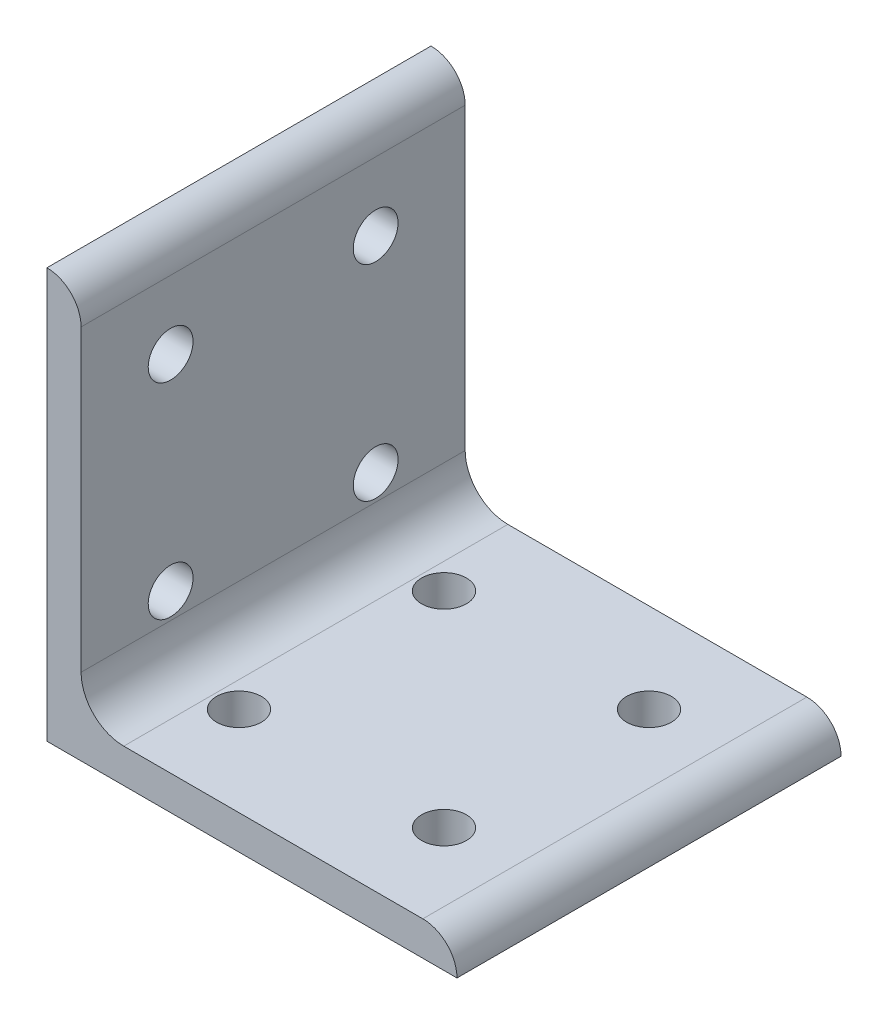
ISO-10303-21;
HEADER;
FILE_DESCRIPTION(('STEP AP214'),'2;1');
FILE_NAME('part.step','',(''),(''),'','','');
FILE_SCHEMA(('AUTOMOTIVE_DESIGN { 1 0 10303 214 1 1 1 1 }'));
ENDSEC;
DATA;
#1=APPLICATION_CONTEXT('core data for automotive mechanical design processes');
#2=APPLICATION_PROTOCOL_DEFINITION('international standard','automotive_design',2000,#1);
#3=PRODUCT_CONTEXT('',#1,'mechanical');
#4=PRODUCT('Part','Part','',(#3));
#5=PRODUCT_RELATED_PRODUCT_CATEGORY('part','',(#4));
#6=PRODUCT_DEFINITION_FORMATION('','',#4);
#7=PRODUCT_DEFINITION_CONTEXT('part definition',#1,'design');
#8=PRODUCT_DEFINITION('design','',#6,#7);
#9=PRODUCT_DEFINITION_SHAPE('','',#8);
#10=(LENGTH_UNIT() NAMED_UNIT(*) SI_UNIT(.MILLI.,.METRE.));
#11=(NAMED_UNIT(*) PLANE_ANGLE_UNIT() SI_UNIT($,.RADIAN.));
#12=(NAMED_UNIT(*) SI_UNIT($,.STERADIAN.) SOLID_ANGLE_UNIT());
#13=UNCERTAINTY_MEASURE_WITH_UNIT(LENGTH_MEASURE(1.E-05),#10,'distance_accuracy_value','');
#14=(GEOMETRIC_REPRESENTATION_CONTEXT(3) GLOBAL_UNCERTAINTY_ASSIGNED_CONTEXT((#13)) GLOBAL_UNIT_ASSIGNED_CONTEXT((#10,
#11,#12)) REPRESENTATION_CONTEXT('',''));
#15=CARTESIAN_POINT('',(0.,0.,0.));
#16=DIRECTION('',(0.,0.,1.));
#17=DIRECTION('',(1.,0.,0.));
#18=AXIS2_PLACEMENT_3D('',#15,#16,#17);
#19=CARTESIAN_POINT('',(76.2,57.15,19.05));
#20=DIRECTION('',(-1.,0.,0.));
#21=DIRECTION('',(0.,-1.,0.));
#22=AXIS2_PLACEMENT_3D('',#19,#20,#21);
#23=CYLINDRICAL_SURFACE('',#22,4.16560000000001);
#24=CARTESIAN_POINT('',(6.34999999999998,57.15,19.05));
#25=DIRECTION('',(-1.,0.,0.));
#26=DIRECTION('',(0.,-1.,0.));
#27=AXIS2_PLACEMENT_3D('',#24,#25,#26);
#28=CIRCLE('',#27,4.16560000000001);
#29=CARTESIAN_POINT('',(6.34999999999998,52.9844,19.05));
#30=VERTEX_POINT('',#29);
#31=EDGE_CURVE('E21',#30,#30,#28,.F.);
#32=ORIENTED_EDGE('',*,*,#31,.T.);
#33=EDGE_LOOP('',(#32));
#34=FACE_BOUND('',#33,.T.);
#35=CARTESIAN_POINT('',(0.,57.15,19.05));
#36=DIRECTION('',(-1.,0.,0.));
#37=DIRECTION('',(0.,-1.,0.));
#38=AXIS2_PLACEMENT_3D('',#35,#36,#37);
#39=CIRCLE('',#38,4.16560000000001);
#40=CARTESIAN_POINT('',(0.,52.9844,19.05));
#41=VERTEX_POINT('',#40);
#42=EDGE_CURVE('E149',#41,#41,#39,.T.);
#43=ORIENTED_EDGE('',*,*,#42,.T.);
#44=EDGE_LOOP('',(#43));
#45=FACE_BOUND('',#44,.T.);
#46=ADVANCED_FACE('F18',(#34,#45),#23,.F.);
#47=CARTESIAN_POINT('',(76.2,19.05,19.05));
#48=DIRECTION('',(-1.,0.,0.));
#49=DIRECTION('',(0.,-1.,0.));
#50=AXIS2_PLACEMENT_3D('',#47,#48,#49);
#51=CYLINDRICAL_SURFACE('',#50,4.1656);
#52=CARTESIAN_POINT('',(6.34999999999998,19.05,19.05));
#53=DIRECTION('',(-1.,0.,0.));
#54=DIRECTION('',(0.,-1.,0.));
#55=AXIS2_PLACEMENT_3D('',#52,#53,#54);
#56=CIRCLE('',#55,4.1656);
#57=CARTESIAN_POINT('',(6.34999999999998,14.8844,19.05));
#58=VERTEX_POINT('',#57);
#59=EDGE_CURVE('E167',#58,#58,#56,.F.);
#60=ORIENTED_EDGE('',*,*,#59,.T.);
#61=EDGE_LOOP('',(#60));
#62=FACE_BOUND('',#61,.T.);
#63=CARTESIAN_POINT('',(0.,19.05,19.05));
#64=DIRECTION('',(-1.,0.,0.));
#65=DIRECTION('',(0.,-1.,0.));
#66=AXIS2_PLACEMENT_3D('',#63,#64,#65);
#67=CIRCLE('',#66,4.1656);
#68=CARTESIAN_POINT('',(0.,14.8844,19.05));
#69=VERTEX_POINT('',#68);
#70=EDGE_CURVE('E146',#69,#69,#67,.T.);
#71=ORIENTED_EDGE('',*,*,#70,.T.);
#72=EDGE_LOOP('',(#71));
#73=FACE_BOUND('',#72,.T.);
#74=ADVANCED_FACE('F274',(#62,#73),#51,.F.);
#75=CARTESIAN_POINT('',(76.2,19.05,-19.05));
#76=DIRECTION('',(-1.,0.,0.));
#77=DIRECTION('',(0.,-1.,0.));
#78=AXIS2_PLACEMENT_3D('',#75,#76,#77);
#79=CYLINDRICAL_SURFACE('',#78,4.1656);
#80=CARTESIAN_POINT('',(6.34999999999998,19.05,-19.05));
#81=DIRECTION('',(-1.,0.,0.));
#82=DIRECTION('',(0.,-1.,0.));
#83=AXIS2_PLACEMENT_3D('',#80,#81,#82);
#84=CIRCLE('',#83,4.1656);
#85=CARTESIAN_POINT('',(6.34999999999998,14.8844,-19.05));
#86=VERTEX_POINT('',#85);
#87=EDGE_CURVE('E165',#86,#86,#84,.F.);
#88=ORIENTED_EDGE('',*,*,#87,.T.);
#89=EDGE_LOOP('',(#88));
#90=FACE_BOUND('',#89,.T.);
#91=CARTESIAN_POINT('',(0.,19.05,-19.05));
#92=DIRECTION('',(-1.,0.,0.));
#93=DIRECTION('',(0.,-1.,0.));
#94=AXIS2_PLACEMENT_3D('',#91,#92,#93);
#95=CIRCLE('',#94,4.1656);
#96=CARTESIAN_POINT('',(0.,14.8844,-19.05));
#97=VERTEX_POINT('',#96);
#98=EDGE_CURVE('E143',#97,#97,#95,.T.);
#99=ORIENTED_EDGE('',*,*,#98,.T.);
#100=EDGE_LOOP('',(#99));
#101=FACE_BOUND('',#100,.T.);
#102=ADVANCED_FACE('F277',(#90,#101),#79,.F.);
#103=CARTESIAN_POINT('',(76.2,57.15,-19.05));
#104=DIRECTION('',(-1.,0.,0.));
#105=DIRECTION('',(0.,-1.,0.));
#106=AXIS2_PLACEMENT_3D('',#103,#104,#105);
#107=CYLINDRICAL_SURFACE('',#106,4.16560000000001);
#108=CARTESIAN_POINT('',(6.34999999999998,57.15,-19.05));
#109=DIRECTION('',(-1.,0.,0.));
#110=DIRECTION('',(0.,-1.,0.));
#111=AXIS2_PLACEMENT_3D('',#108,#109,#110);
#112=CIRCLE('',#111,4.16560000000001);
#113=CARTESIAN_POINT('',(6.34999999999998,52.9844,-19.05));
#114=VERTEX_POINT('',#113);
#115=EDGE_CURVE('E95',#114,#114,#112,.F.);
#116=ORIENTED_EDGE('',*,*,#115,.T.);
#117=EDGE_LOOP('',(#116));
#118=FACE_BOUND('',#117,.T.);
#119=CARTESIAN_POINT('',(0.,57.15,-19.05));
#120=DIRECTION('',(-1.,0.,0.));
#121=DIRECTION('',(0.,-1.,0.));
#122=AXIS2_PLACEMENT_3D('',#119,#120,#121);
#123=CIRCLE('',#122,4.16560000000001);
#124=CARTESIAN_POINT('',(0.,52.9844,-19.05));
#125=VERTEX_POINT('',#124);
#126=EDGE_CURVE('E117',#125,#125,#123,.T.);
#127=ORIENTED_EDGE('',*,*,#126,.T.);
#128=EDGE_LOOP('',(#127));
#129=FACE_BOUND('',#128,.T.);
#130=ADVANCED_FACE('F187',(#118,#129),#107,.F.);
#131=CARTESIAN_POINT('',(14.2748,14.2748,35.687));
#132=DIRECTION('',(0.,0.,-1.));
#133=DIRECTION('',(-1.,0.,0.));
#134=AXIS2_PLACEMENT_3D('',#131,#132,#133);
#135=CYLINDRICAL_SURFACE('',#134,7.9248);
#136=DIRECTION('',(0.,0.,1.));
#137=VECTOR('',#136,1.);
#138=CARTESIAN_POINT('',(6.34999999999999,14.2748,35.687));
#139=LINE('',#138,#137);
#140=CARTESIAN_POINT('',(6.34999999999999,14.2748,-35.687));
#141=VERTEX_POINT('',#140);
#142=CARTESIAN_POINT('',(6.34999999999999,14.2748,35.687));
#143=VERTEX_POINT('',#142);
#144=EDGE_CURVE('E88',#141,#143,#139,.T.);
#145=ORIENTED_EDGE('',*,*,#144,.T.);
#146=CARTESIAN_POINT('',(14.2748,14.2748,35.687));
#147=DIRECTION('',(0.,0.,-1.));
#148=DIRECTION('',(-1.,0.,0.));
#149=AXIS2_PLACEMENT_3D('',#146,#147,#148);
#150=CIRCLE('',#149,7.9248);
#151=CARTESIAN_POINT('',(14.2748,6.34999999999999,35.687));
#152=VERTEX_POINT('',#151);
#153=EDGE_CURVE('E77',#152,#143,#150,.T.);
#154=ORIENTED_EDGE('',*,*,#153,.F.);
#155=DIRECTION('',(0.,0.,-1.));
#156=VECTOR('',#155,1.);
#157=CARTESIAN_POINT('',(14.2748,6.34999999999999,35.687));
#158=LINE('',#157,#156);
#159=CARTESIAN_POINT('',(14.2748,6.34999999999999,-35.687));
#160=VERTEX_POINT('',#159);
#161=EDGE_CURVE('E72',#152,#160,#158,.T.);
#162=ORIENTED_EDGE('',*,*,#161,.T.);
#163=CARTESIAN_POINT('',(14.2748,14.2748,-35.687));
#164=DIRECTION('',(0.,0.,-1.));
#165=DIRECTION('',(-1.,0.,0.));
#166=AXIS2_PLACEMENT_3D('',#163,#164,#165);
#167=CIRCLE('',#166,7.9248);
#168=EDGE_CURVE('E90',#160,#141,#167,.T.);
#169=ORIENTED_EDGE('',*,*,#168,.T.);
#170=EDGE_LOOP('',(#145,#154,#162,#169));
#171=FACE_BOUND('',#170,.T.);
#172=ADVANCED_FACE('F89',(#171),#135,.F.);
#173=CARTESIAN_POINT('',(6.34999999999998,76.2,35.687));
#174=DIRECTION('',(-1.,0.,0.));
#175=DIRECTION('',(0.,-1.,0.));
#176=AXIS2_PLACEMENT_3D('',#173,#174,#175);
#177=PLANE('',#176);
#178=DIRECTION('',(0.,0.,-1.));
#179=VECTOR('',#178,1.);
#180=CARTESIAN_POINT('',(6.34999999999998,69.85,35.687));
#181=LINE('',#180,#179);
#182=CARTESIAN_POINT('',(6.34999999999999,69.85,35.687));
#183=VERTEX_POINT('',#182);
#184=CARTESIAN_POINT('',(6.34999999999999,69.85,-35.687));
#185=VERTEX_POINT('',#184);
#186=EDGE_CURVE('E94',#183,#185,#181,.T.);
#187=ORIENTED_EDGE('',*,*,#186,.F.);
#188=DIRECTION('',(0.,1.,0.));
#189=VECTOR('',#188,1.);
#190=CARTESIAN_POINT('',(6.34999999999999,14.2748,35.687));
#191=LINE('',#190,#189);
#192=EDGE_CURVE('E81',#143,#183,#191,.T.);
#193=ORIENTED_EDGE('',*,*,#192,.F.);
#194=ORIENTED_EDGE('',*,*,#144,.F.);
#195=DIRECTION('',(0.,1.,0.));
#196=VECTOR('',#195,1.);
#197=CARTESIAN_POINT('',(6.34999999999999,14.2748,-35.687));
#198=LINE('',#197,#196);
#199=EDGE_CURVE('E138',#141,#185,#198,.T.);
#200=ORIENTED_EDGE('',*,*,#199,.T.);
#201=EDGE_LOOP('',(#187,#193,#194,#200));
#202=FACE_BOUND('',#201,.T.);
#203=ORIENTED_EDGE('',*,*,#115,.F.);
#204=EDGE_LOOP('',(#203));
#205=FACE_BOUND('',#204,.T.);
#206=ORIENTED_EDGE('',*,*,#87,.F.);
#207=EDGE_LOOP('',(#206));
#208=FACE_BOUND('',#207,.T.);
#209=ORIENTED_EDGE('',*,*,#59,.F.);
#210=EDGE_LOOP('',(#209));
#211=FACE_BOUND('',#210,.T.);
#212=ORIENTED_EDGE('',*,*,#31,.F.);
#213=EDGE_LOOP('',(#212));
#214=FACE_BOUND('',#213,.T.);
#215=ADVANCED_FACE('F97',(#202,#205,#208,#211,#214),#177,.F.);
#216=CARTESIAN_POINT('',(0.,69.85,35.687));
#217=DIRECTION('',(0.,0.,-1.));
#218=DIRECTION('',(-1.,0.,0.));
#219=AXIS2_PLACEMENT_3D('',#216,#217,#218);
#220=CYLINDRICAL_SURFACE('',#219,6.35);
#221=CARTESIAN_POINT('',(0.,69.85,-35.687));
#222=DIRECTION('',(0.,0.,-1.));
#223=DIRECTION('',(-1.,0.,0.));
#224=AXIS2_PLACEMENT_3D('',#221,#222,#223);
#225=CIRCLE('',#224,6.35);
#226=CARTESIAN_POINT('',(0.,76.2,-35.687));
#227=VERTEX_POINT('',#226);
#228=EDGE_CURVE('E135',#185,#227,#225,.F.);
#229=ORIENTED_EDGE('',*,*,#228,.T.);
#230=DIRECTION('',(0.,0.,1.));
#231=VECTOR('',#230,1.);
#232=CARTESIAN_POINT('',(0.,76.2,35.687));
#233=LINE('',#232,#231);
#234=CARTESIAN_POINT('',(0.,76.2,35.687));
#235=VERTEX_POINT('',#234);
#236=EDGE_CURVE('E108',#227,#235,#233,.T.);
#237=ORIENTED_EDGE('',*,*,#236,.T.);
#238=CARTESIAN_POINT('',(0.,69.85,35.687));
#239=DIRECTION('',(0.,0.,-1.));
#240=DIRECTION('',(-1.,0.,0.));
#241=AXIS2_PLACEMENT_3D('',#238,#239,#240);
#242=CIRCLE('',#241,6.35);
#243=EDGE_CURVE('E100',#183,#235,#242,.F.);
#244=ORIENTED_EDGE('',*,*,#243,.F.);
#245=ORIENTED_EDGE('',*,*,#186,.T.);
#246=EDGE_LOOP('',(#229,#237,#244,#245));
#247=FACE_BOUND('',#246,.T.);
#248=ADVANCED_FACE('F177',(#247),#220,.T.);
#249=CARTESIAN_POINT('',(14.2748,6.34999999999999,35.687));
#250=DIRECTION('',(0.,-1.,0.));
#251=DIRECTION('',(0.,0.,-1.));
#252=AXIS2_PLACEMENT_3D('',#249,#250,#251);
#253=PLANE('',#252);
#254=DIRECTION('',(0.,0.,-1.));
#255=VECTOR('',#254,1.);
#256=CARTESIAN_POINT('',(69.85,6.34999999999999,35.687));
#257=LINE('',#256,#255);
#258=CARTESIAN_POINT('',(69.85,6.34999999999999,-35.687));
#259=VERTEX_POINT('',#258);
#260=CARTESIAN_POINT('',(69.85,6.34999999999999,35.687));
#261=VERTEX_POINT('',#260);
#262=EDGE_CURVE('E111',#259,#261,#257,.F.);
#263=ORIENTED_EDGE('',*,*,#262,.F.);
#264=DIRECTION('',(1.,0.,0.));
#265=VECTOR('',#264,1.);
#266=CARTESIAN_POINT('',(14.2748,6.34999999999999,-35.687));
#267=LINE('',#266,#265);
#268=EDGE_CURVE('E132',#259,#160,#267,.F.);
#269=ORIENTED_EDGE('',*,*,#268,.T.);
#270=ORIENTED_EDGE('',*,*,#161,.F.);
#271=DIRECTION('',(1.,0.,0.));
#272=VECTOR('',#271,1.);
#273=CARTESIAN_POINT('',(14.2748,6.34999999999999,35.687));
#274=LINE('',#273,#272);
#275=EDGE_CURVE('E84',#261,#152,#274,.F.);
#276=ORIENTED_EDGE('',*,*,#275,.F.);
#277=EDGE_LOOP('',(#263,#269,#270,#276));
#278=FACE_BOUND('',#277,.T.);
#279=CARTESIAN_POINT('',(57.15,6.34999999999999,19.05));
#280=DIRECTION('',(0.,-1.,0.));
#281=DIRECTION('',(1.,0.,0.));
#282=AXIS2_PLACEMENT_3D('',#279,#280,#281);
#283=CIRCLE('',#282,4.1656);
#284=CARTESIAN_POINT('',(61.3156,6.34999999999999,19.05));
#285=VERTEX_POINT('',#284);
#286=EDGE_CURVE('E152',#285,#285,#283,.T.);
#287=ORIENTED_EDGE('',*,*,#286,.T.);
#288=EDGE_LOOP('',(#287));
#289=FACE_BOUND('',#288,.T.);
#290=CARTESIAN_POINT('',(19.05,6.34999999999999,-19.05));
#291=DIRECTION('',(0.,-1.,0.));
#292=DIRECTION('',(1.,0.,0.));
#293=AXIS2_PLACEMENT_3D('',#290,#291,#292);
#294=CIRCLE('',#293,4.1656);
#295=CARTESIAN_POINT('',(23.2156,6.34999999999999,-19.05));
#296=VERTEX_POINT('',#295);
#297=EDGE_CURVE('E155',#296,#296,#294,.T.);
#298=ORIENTED_EDGE('',*,*,#297,.T.);
#299=EDGE_LOOP('',(#298));
#300=FACE_BOUND('',#299,.T.);
#301=CARTESIAN_POINT('',(19.05,6.34999999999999,19.05));
#302=DIRECTION('',(0.,-1.,0.));
#303=DIRECTION('',(1.,0.,0.));
#304=AXIS2_PLACEMENT_3D('',#301,#302,#303);
#305=CIRCLE('',#304,4.1656);
#306=CARTESIAN_POINT('',(23.2156,6.34999999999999,19.05));
#307=VERTEX_POINT('',#306);
#308=EDGE_CURVE('E158',#307,#307,#305,.T.);
#309=ORIENTED_EDGE('',*,*,#308,.T.);
#310=EDGE_LOOP('',(#309));
#311=FACE_BOUND('',#310,.T.);
#312=CARTESIAN_POINT('',(57.15,6.34999999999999,-19.05));
#313=DIRECTION('',(0.,-1.,0.));
#314=DIRECTION('',(1.,0.,0.));
#315=AXIS2_PLACEMENT_3D('',#312,#313,#314);
#316=CIRCLE('',#315,4.1656);
#317=CARTESIAN_POINT('',(61.3156,6.34999999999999,-19.05));
#318=VERTEX_POINT('',#317);
#319=EDGE_CURVE('E110',#318,#318,#316,.T.);
#320=ORIENTED_EDGE('',*,*,#319,.T.);
#321=EDGE_LOOP('',(#320));
#322=FACE_BOUND('',#321,.T.);
#323=ADVANCED_FACE('F184',(#278,#289,#300,#311,#322),#253,.F.);
#324=CARTESIAN_POINT('',(57.15,76.201,-19.05));
#325=DIRECTION('',(0.,-1.,0.));
#326=DIRECTION('',(1.,0.,0.));
#327=AXIS2_PLACEMENT_3D('',#324,#325,#326);
#328=CYLINDRICAL_SURFACE('',#327,4.1656);
#329=ORIENTED_EDGE('',*,*,#319,.F.);
#330=EDGE_LOOP('',(#329));
#331=FACE_BOUND('',#330,.T.);
#332=CARTESIAN_POINT('',(57.15,0.,-19.05));
#333=DIRECTION('',(0.,-1.,0.));
#334=DIRECTION('',(1.,0.,0.));
#335=AXIS2_PLACEMENT_3D('',#332,#333,#334);
#336=CIRCLE('',#335,4.1656);
#337=CARTESIAN_POINT('',(61.3156,0.,-19.05));
#338=VERTEX_POINT('',#337);
#339=EDGE_CURVE('E129',#338,#338,#336,.T.);
#340=ORIENTED_EDGE('',*,*,#339,.T.);
#341=EDGE_LOOP('',(#340));
#342=FACE_BOUND('',#341,.T.);
#343=ADVANCED_FACE('F222',(#331,#342),#328,.F.);
#344=CARTESIAN_POINT('',(19.05,76.201,19.05));
#345=DIRECTION('',(0.,-1.,0.));
#346=DIRECTION('',(1.,0.,0.));
#347=AXIS2_PLACEMENT_3D('',#344,#345,#346);
#348=CYLINDRICAL_SURFACE('',#347,4.1656);
#349=ORIENTED_EDGE('',*,*,#308,.F.);
#350=EDGE_LOOP('',(#349));
#351=FACE_BOUND('',#350,.T.);
#352=CARTESIAN_POINT('',(19.05,0.,19.05));
#353=DIRECTION('',(0.,-1.,0.));
#354=DIRECTION('',(1.,0.,0.));
#355=AXIS2_PLACEMENT_3D('',#352,#353,#354);
#356=CIRCLE('',#355,4.1656);
#357=CARTESIAN_POINT('',(23.2156,0.,19.05));
#358=VERTEX_POINT('',#357);
#359=EDGE_CURVE('E126',#358,#358,#356,.T.);
#360=ORIENTED_EDGE('',*,*,#359,.T.);
#361=EDGE_LOOP('',(#360));
#362=FACE_BOUND('',#361,.T.);
#363=ADVANCED_FACE('F218',(#351,#362),#348,.F.);
#364=CARTESIAN_POINT('',(19.05,76.201,-19.05));
#365=DIRECTION('',(0.,-1.,0.));
#366=DIRECTION('',(1.,0.,0.));
#367=AXIS2_PLACEMENT_3D('',#364,#365,#366);
#368=CYLINDRICAL_SURFACE('',#367,4.1656);
#369=ORIENTED_EDGE('',*,*,#297,.F.);
#370=EDGE_LOOP('',(#369));
#371=FACE_BOUND('',#370,.T.);
#372=CARTESIAN_POINT('',(19.05,0.,-19.05));
#373=DIRECTION('',(0.,-1.,0.));
#374=DIRECTION('',(1.,0.,0.));
#375=AXIS2_PLACEMENT_3D('',#372,#373,#374);
#376=CIRCLE('',#375,4.1656);
#377=CARTESIAN_POINT('',(23.2156,0.,-19.05));
#378=VERTEX_POINT('',#377);
#379=EDGE_CURVE('E123',#378,#378,#376,.T.);
#380=ORIENTED_EDGE('',*,*,#379,.T.);
#381=EDGE_LOOP('',(#380));
#382=FACE_BOUND('',#381,.T.);
#383=ADVANCED_FACE('F214',(#371,#382),#368,.F.);
#384=CARTESIAN_POINT('',(57.15,76.201,19.05));
#385=DIRECTION('',(0.,-1.,0.));
#386=DIRECTION('',(1.,0.,0.));
#387=AXIS2_PLACEMENT_3D('',#384,#385,#386);
#388=CYLINDRICAL_SURFACE('',#387,4.1656);
#389=ORIENTED_EDGE('',*,*,#286,.F.);
#390=EDGE_LOOP('',(#389));
#391=FACE_BOUND('',#390,.T.);
#392=CARTESIAN_POINT('',(57.15,0.,19.05));
#393=DIRECTION('',(0.,-1.,0.));
#394=DIRECTION('',(1.,0.,0.));
#395=AXIS2_PLACEMENT_3D('',#392,#393,#394);
#396=CIRCLE('',#395,4.1656);
#397=CARTESIAN_POINT('',(61.3156,0.,19.05));
#398=VERTEX_POINT('',#397);
#399=EDGE_CURVE('E119',#398,#398,#396,.T.);
#400=ORIENTED_EDGE('',*,*,#399,.T.);
#401=EDGE_LOOP('',(#400));
#402=FACE_BOUND('',#401,.T.);
#403=ADVANCED_FACE('F210',(#391,#402),#388,.F.);
#404=CARTESIAN_POINT('',(0.,0.,35.687));
#405=DIRECTION('',(1.,0.,0.));
#406=DIRECTION('',(0.,1.,0.));
#407=AXIS2_PLACEMENT_3D('',#404,#405,#406);
#408=PLANE('',#407);
#409=DIRECTION('',(0.,0.,1.));
#410=VECTOR('',#409,1.);
#411=CARTESIAN_POINT('',(0.,0.,35.687));
#412=LINE('',#411,#410);
#413=CARTESIAN_POINT('',(0.,0.,-35.687));
#414=VERTEX_POINT('',#413);
#415=CARTESIAN_POINT('',(0.,0.,35.687));
#416=VERTEX_POINT('',#415);
#417=EDGE_CURVE('E122',#414,#416,#412,.T.);
#418=ORIENTED_EDGE('',*,*,#417,.T.);
#419=DIRECTION('',(0.,1.,0.));
#420=VECTOR('',#419,1.);
#421=CARTESIAN_POINT('',(0.,14.2748,35.687));
#422=LINE('',#421,#420);
#423=EDGE_CURVE('E102',#235,#416,#422,.F.);
#424=ORIENTED_EDGE('',*,*,#423,.F.);
#425=ORIENTED_EDGE('',*,*,#236,.F.);
#426=DIRECTION('',(0.,1.,0.));
#427=VECTOR('',#426,1.);
#428=CARTESIAN_POINT('',(0.,14.2748,-35.687));
#429=LINE('',#428,#427);
#430=EDGE_CURVE('E134',#227,#414,#429,.F.);
#431=ORIENTED_EDGE('',*,*,#430,.T.);
#432=EDGE_LOOP('',(#418,#424,#425,#431));
#433=FACE_BOUND('',#432,.T.);
#434=ORIENTED_EDGE('',*,*,#126,.F.);
#435=EDGE_LOOP('',(#434));
#436=FACE_BOUND('',#435,.T.);
#437=ORIENTED_EDGE('',*,*,#98,.F.);
#438=EDGE_LOOP('',(#437));
#439=FACE_BOUND('',#438,.T.);
#440=ORIENTED_EDGE('',*,*,#70,.F.);
#441=EDGE_LOOP('',(#440));
#442=FACE_BOUND('',#441,.T.);
#443=ORIENTED_EDGE('',*,*,#42,.F.);
#444=EDGE_LOOP('',(#443));
#445=FACE_BOUND('',#444,.T.);
#446=ADVANCED_FACE('F207',(#433,#436,#439,#442,#445),#408,.F.);
#447=CARTESIAN_POINT('',(14.2748,14.2748,35.687));
#448=DIRECTION('',(0.,0.,1.));
#449=DIRECTION('',(1.,0.,0.));
#450=AXIS2_PLACEMENT_3D('',#447,#448,#449);
#451=PLANE('',#450);
#452=ORIENTED_EDGE('',*,*,#243,.T.);
#453=ORIENTED_EDGE('',*,*,#423,.T.);
#454=DIRECTION('',(-1.,0.,0.));
#455=VECTOR('',#454,1.);
#456=CARTESIAN_POINT('',(76.2,0.,35.687));
#457=LINE('',#456,#455);
#458=CARTESIAN_POINT('',(76.2,0.,35.687));
#459=VERTEX_POINT('',#458);
#460=EDGE_CURVE('E253',#416,#459,#457,.F.);
#461=ORIENTED_EDGE('',*,*,#460,.T.);
#462=CARTESIAN_POINT('',(69.85,0.,35.687));
#463=DIRECTION('',(0.,0.,-1.));
#464=DIRECTION('',(-1.,0.,0.));
#465=AXIS2_PLACEMENT_3D('',#462,#463,#464);
#466=CIRCLE('',#465,6.34999999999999);
#467=EDGE_CURVE('E114',#261,#459,#466,.T.);
#468=ORIENTED_EDGE('',*,*,#467,.F.);
#469=ORIENTED_EDGE('',*,*,#275,.T.);
#470=ORIENTED_EDGE('',*,*,#153,.T.);
#471=ORIENTED_EDGE('',*,*,#192,.T.);
#472=EDGE_LOOP('',(#452,#453,#461,#468,#469,#470,#471));
#473=FACE_BOUND('',#472,.T.);
#474=ADVANCED_FACE('F79',(#473),#451,.T.);
#475=CARTESIAN_POINT('',(69.85,0.,35.687));
#476=DIRECTION('',(0.,0.,-1.));
#477=DIRECTION('',(-1.,0.,0.));
#478=AXIS2_PLACEMENT_3D('',#475,#476,#477);
#479=CYLINDRICAL_SURFACE('',#478,6.34999999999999);
#480=CARTESIAN_POINT('',(69.85,0.,-35.687));
#481=DIRECTION('',(0.,0.,-1.));
#482=DIRECTION('',(-1.,0.,0.));
#483=AXIS2_PLACEMENT_3D('',#480,#481,#482);
#484=CIRCLE('',#483,6.34999999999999);
#485=CARTESIAN_POINT('',(76.2,0.,-35.687));
#486=VERTEX_POINT('',#485);
#487=EDGE_CURVE('E35',#486,#259,#484,.F.);
#488=ORIENTED_EDGE('',*,*,#487,.T.);
#489=ORIENTED_EDGE('',*,*,#262,.T.);
#490=ORIENTED_EDGE('',*,*,#467,.T.);
#491=DIRECTION('',(0.,0.,1.));
#492=VECTOR('',#491,1.);
#493=CARTESIAN_POINT('',(76.2,0.,35.687));
#494=LINE('',#493,#492);
#495=EDGE_CURVE('E27',#459,#486,#494,.F.);
#496=ORIENTED_EDGE('',*,*,#495,.T.);
#497=EDGE_LOOP('',(#488,#489,#490,#496));
#498=FACE_BOUND('',#497,.T.);
#499=ADVANCED_FACE('F197',(#498),#479,.T.);
#500=CARTESIAN_POINT('',(14.2748,14.2748,-35.687));
#501=DIRECTION('',(0.,0.,1.));
#502=DIRECTION('',(1.,0.,0.));
#503=AXIS2_PLACEMENT_3D('',#500,#501,#502);
#504=PLANE('',#503);
#505=ORIENTED_EDGE('',*,*,#487,.F.);
#506=DIRECTION('',(-1.,0.,0.));
#507=VECTOR('',#506,1.);
#508=CARTESIAN_POINT('',(76.2,0.,-35.687));
#509=LINE('',#508,#507);
#510=EDGE_CURVE('E11',#486,#414,#509,.T.);
#511=ORIENTED_EDGE('',*,*,#510,.T.);
#512=ORIENTED_EDGE('',*,*,#430,.F.);
#513=ORIENTED_EDGE('',*,*,#228,.F.);
#514=ORIENTED_EDGE('',*,*,#199,.F.);
#515=ORIENTED_EDGE('',*,*,#168,.F.);
#516=ORIENTED_EDGE('',*,*,#268,.F.);
#517=EDGE_LOOP('',(#505,#511,#512,#513,#514,#515,#516));
#518=FACE_BOUND('',#517,.T.);
#519=ADVANCED_FACE('F191',(#518),#504,.F.);
#520=CARTESIAN_POINT('',(76.2,0.,35.687));
#521=DIRECTION('',(0.,1.,0.));
#522=DIRECTION('',(-1.,0.,0.));
#523=AXIS2_PLACEMENT_3D('',#520,#521,#522);
#524=PLANE('',#523);
#525=ORIENTED_EDGE('',*,*,#495,.F.);
#526=ORIENTED_EDGE('',*,*,#460,.F.);
#527=ORIENTED_EDGE('',*,*,#417,.F.);
#528=ORIENTED_EDGE('',*,*,#510,.F.);
#529=EDGE_LOOP('',(#525,#526,#527,#528));
#530=FACE_BOUND('',#529,.T.);
#531=ORIENTED_EDGE('',*,*,#399,.F.);
#532=EDGE_LOOP('',(#531));
#533=FACE_BOUND('',#532,.T.);
#534=ORIENTED_EDGE('',*,*,#379,.F.);
#535=EDGE_LOOP('',(#534));
#536=FACE_BOUND('',#535,.T.);
#537=ORIENTED_EDGE('',*,*,#359,.F.);
#538=EDGE_LOOP('',(#537));
#539=FACE_BOUND('',#538,.T.);
#540=ORIENTED_EDGE('',*,*,#339,.F.);
#541=EDGE_LOOP('',(#540));
#542=FACE_BOUND('',#541,.T.);
#543=ADVANCED_FACE('F189',(#530,#533,#536,#539,#542),#524,.F.);
#544=CLOSED_SHELL('',(#46,#74,#102,#130,#172,#215,#248,#323,#343,#363,#383,#403,#446,#474,#499,
#519,#543));
#545=MANIFOLD_SOLID_BREP('B1',#544);
#546=ADVANCED_BREP_SHAPE_REPRESENTATION('',(#18,#545),#14);
#547=SHAPE_DEFINITION_REPRESENTATION(#9,#546);
ENDSEC;
END-ISO-10303-21;
